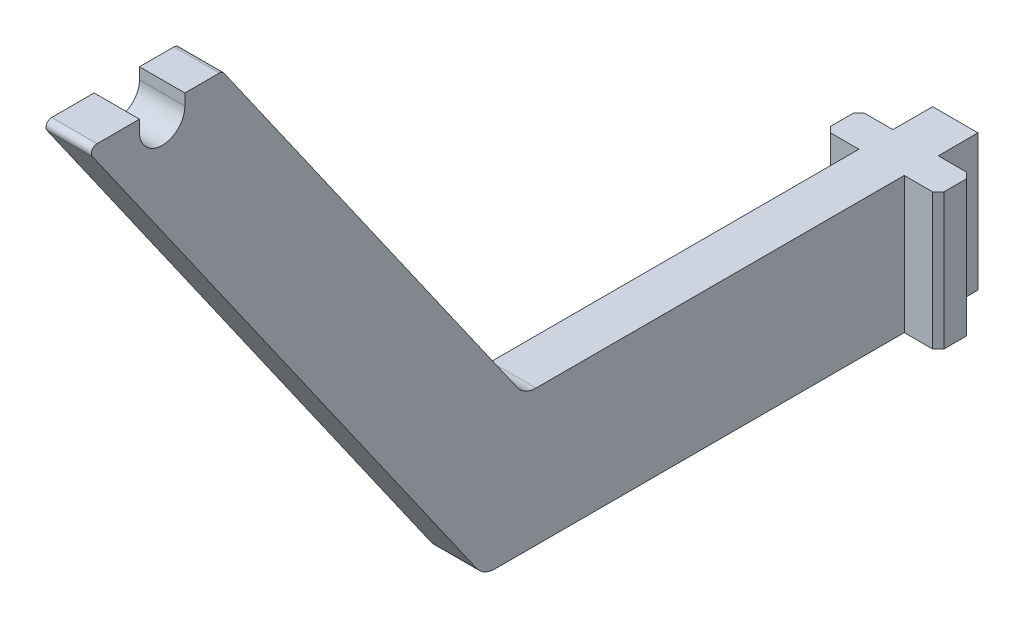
from build123d import *

# Parameters (mm, degrees)
EXTRUDE_1_DEPTH     = 1
SKETCH_2_W          = 1.5
SKETCH_2_H          = 1.5
EXTRUDE_2_DEPTH     = 6
CUT_EXTRUDE_1_DEPTH = 47.712417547
FILLET_1_R          = 1
FILLET_2_R          = 0.25
CHAMFER_1_SIZE      = 0.25


with BuildPart() as part:
    # Sketch 1 → Extrude 1 (new, symmetric)
    with BuildSketch(Plane(origin=(0, 0, 0), x_dir=(0, 0, -1), z_dir=(1, 0, 0))):
        Polygon((0, 0), (0, 6), (-20, 6), (-33.303943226, 25), (-39.303943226, 25), (-21.798754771, 0), align=None)
    extrude(amount=EXTRUDE_1_DEPTH, both=True)

    # Sketch 2 → Extrude 2 (add)
    with BuildSketch(Plane(origin=(0, 6, 0), x_dir=(1, 0, 0), z_dir=(0, 1, 0))):
        with Locations((-1.75, -2.5)):
            Rectangle(SKETCH_2_W, SKETCH_2_H)
        with Locations((1.75, -2.5)):
            Rectangle(SKETCH_2_W, SKETCH_2_H)
    extrude(amount=-EXTRUDE_2_DEPTH)

    # Sketch 3 → Cut-Extrude 1 (cut, through all)
    with BuildSketch(Plane.ZY.offset(1)):
        with BuildLine():
            Line((34.953839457, 24.5), (34.953839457, 25))
            Line((34.953839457, 25), (36.953839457, 25))
            Line((36.953839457, 25), (36.953839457, 24.5))
            ThreePointArc((36.953839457, 24.5), (35.953839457, 23.5), (34.953839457, 24.5))
        make_face()
    extrude(amount=-CUT_EXTRUDE_1_DEPTH, mode=Mode.SUBTRACT)

    # Fillet 1
    fillet_1_edges = [part.edges().sort_by_distance(p)[0] for p in [
        (0, 6, 20),
        (0, 0, 21.798754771),
    ]]
    fillet(fillet_1_edges, radius=FILLET_1_R)

    # Fillet 2
    fillet_2_edges = [part.edges().sort_by_distance(p)[0] for p in [
        (0, 25, 39.303943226),
        (0, 25, 33.303943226),
    ]]
    fillet(fillet_2_edges, radius=FILLET_2_R)

    # Chamfer 1
    chamfer_1_edges = [part.edges().sort_by_distance(p)[0] for p in [
        (-2.5, 3, 3.25),
        (-2.5, 3, 1.75),
        (2.5, 3, 3.25),
        (2.5, 3, 1.75),
    ]]
    chamfer(chamfer_1_edges, length=CHAMFER_1_SIZE)


solid = part.part
